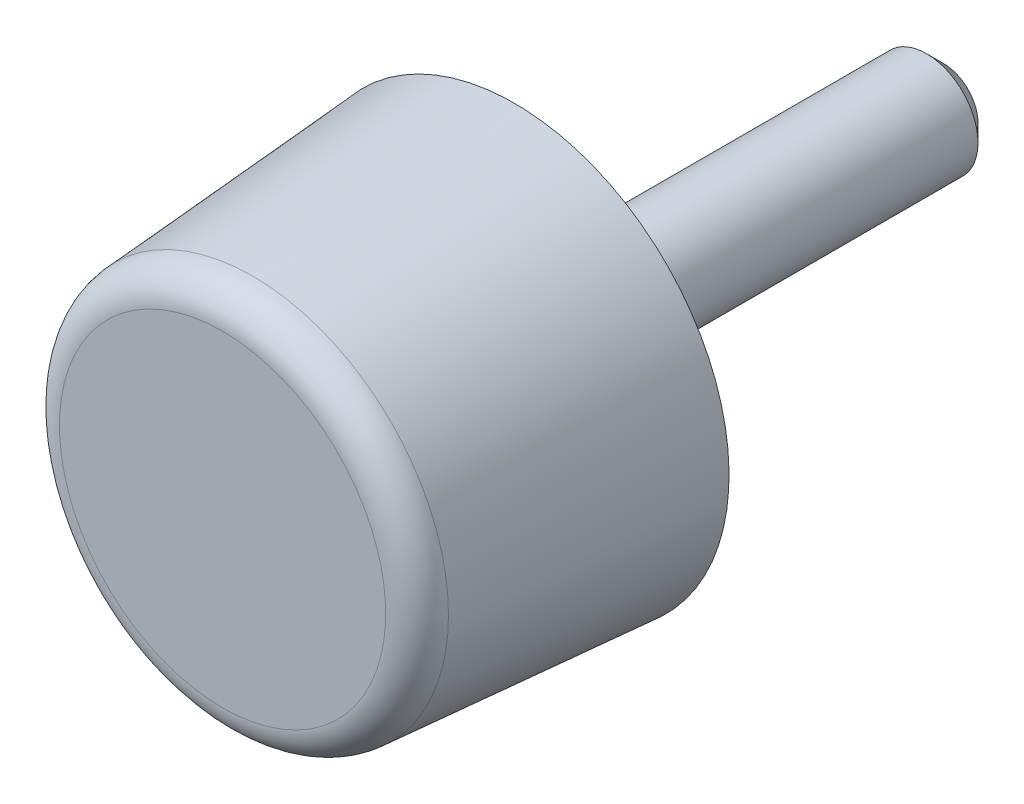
ISO-10303-21;
HEADER;
FILE_DESCRIPTION(('STEP AP214'),'2;1');
FILE_NAME('part.step','',(''),(''),'','','');
FILE_SCHEMA(('AUTOMOTIVE_DESIGN { 1 0 10303 214 1 1 1 1 }'));
ENDSEC;
DATA;
#1=APPLICATION_CONTEXT('core data for automotive mechanical design processes');
#2=APPLICATION_PROTOCOL_DEFINITION('international standard','automotive_design',2000,#1);
#3=PRODUCT_CONTEXT('',#1,'mechanical');
#4=PRODUCT('Part','Part','',(#3));
#5=PRODUCT_RELATED_PRODUCT_CATEGORY('part','',(#4));
#6=PRODUCT_DEFINITION_FORMATION('','',#4);
#7=PRODUCT_DEFINITION_CONTEXT('part definition',#1,'design');
#8=PRODUCT_DEFINITION('design','',#6,#7);
#9=PRODUCT_DEFINITION_SHAPE('','',#8);
#10=(LENGTH_UNIT() NAMED_UNIT(*) SI_UNIT(.MILLI.,.METRE.));
#11=(NAMED_UNIT(*) PLANE_ANGLE_UNIT() SI_UNIT($,.RADIAN.));
#12=(NAMED_UNIT(*) SI_UNIT($,.STERADIAN.) SOLID_ANGLE_UNIT());
#13=UNCERTAINTY_MEASURE_WITH_UNIT(LENGTH_MEASURE(1.E-05),#10,'distance_accuracy_value','');
#14=(GEOMETRIC_REPRESENTATION_CONTEXT(3) GLOBAL_UNCERTAINTY_ASSIGNED_CONTEXT((#13)) GLOBAL_UNIT_ASSIGNED_CONTEXT((#10,
#11,#12)) REPRESENTATION_CONTEXT('',''));
#15=CARTESIAN_POINT('',(0.,0.,0.));
#16=DIRECTION('',(0.,0.,1.));
#17=DIRECTION('',(1.,0.,0.));
#18=AXIS2_PLACEMENT_3D('',#15,#16,#17);
#19=CARTESIAN_POINT('',(0.,0.,17.));
#20=DIRECTION('',(0.,0.,1.));
#21=DIRECTION('',(0.,-1.,0.));
#22=AXIS2_PLACEMENT_3D('',#19,#20,#21);
#23=CYLINDRICAL_SURFACE('',#22,11.25);
#24=CARTESIAN_POINT('',(0.,0.,0.));
#25=DIRECTION('',(0.,0.,1.));
#26=DIRECTION('',(0.,-1.,0.));
#27=AXIS2_PLACEMENT_3D('',#24,#25,#26);
#28=CIRCLE('',#27,11.25);
#29=CARTESIAN_POINT('',(0.,-11.25,0.));
#30=VERTEX_POINT('',#29);
#31=EDGE_CURVE('E27',#30,#30,#28,.T.);
#32=ORIENTED_EDGE('',*,*,#31,.F.);
#33=EDGE_LOOP('',(#32));
#34=FACE_BOUND('',#33,.T.);
#35=CARTESIAN_POINT('',(0.,0.,0.0500000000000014));
#36=DIRECTION('',(0.,0.,1.));
#37=DIRECTION('',(0.,-1.,0.));
#38=AXIS2_PLACEMENT_3D('',#35,#36,#37);
#39=CIRCLE('',#38,11.25);
#40=CARTESIAN_POINT('',(0.,-11.25,0.0500000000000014));
#41=VERTEX_POINT('',#40);
#42=EDGE_CURVE('E44',#41,#41,#39,.T.);
#43=ORIENTED_EDGE('',*,*,#42,.T.);
#44=EDGE_LOOP('',(#43));
#45=FACE_BOUND('',#44,.T.);
#46=ADVANCED_FACE('F12',(#34,#45),#23,.F.);
#47=CARTESIAN_POINT('',(11.25,0.,0.));
#48=DIRECTION('',(0.,0.,1.));
#49=DIRECTION('',(0.,-1.,0.));
#50=AXIS2_PLACEMENT_3D('',#47,#48,#49);
#51=PLANE('',#50);
#52=CARTESIAN_POINT('',(0.,0.,0.));
#53=DIRECTION('',(0.,0.,1.));
#54=DIRECTION('',(0.,-1.,0.));
#55=AXIS2_PLACEMENT_3D('',#52,#53,#54);
#56=CIRCLE('',#55,12.5);
#57=CARTESIAN_POINT('',(0.,-12.5,0.));
#58=VERTEX_POINT('',#57);
#59=EDGE_CURVE('E32',#58,#58,#56,.T.);
#60=ORIENTED_EDGE('',*,*,#59,.F.);
#61=EDGE_LOOP('',(#60));
#62=FACE_BOUND('',#61,.T.);
#63=ORIENTED_EDGE('',*,*,#31,.T.);
#64=EDGE_LOOP('',(#63));
#65=FACE_BOUND('',#64,.T.);
#66=ADVANCED_FACE('F72',(#62,#65),#51,.F.);
#67=CARTESIAN_POINT('',(0.,0.,0.));
#68=DIRECTION('',(0.,0.,-1.));
#69=DIRECTION('',(0.,1.,0.));
#70=AXIS2_PLACEMENT_3D('',#67,#68,#69);
#71=CONICAL_SURFACE('',#70,12.5,0.0723905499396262);
#72=CARTESIAN_POINT('',(0.,0.,15.2374219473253));
#73=DIRECTION('',(0.,0.,1.));
#74=DIRECTION('',(0.,-1.,0.));
#75=AXIS2_PLACEMENT_3D('',#72,#73,#74);
#76=CIRCLE('',#75,11.3950238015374);
#77=CARTESIAN_POINT('',(0.,-11.3950238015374,15.2374219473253));
#78=VERTEX_POINT('',#77);
#79=EDGE_CURVE('E35',#78,#78,#76,.T.);
#80=ORIENTED_EDGE('',*,*,#79,.F.);
#81=EDGE_LOOP('',(#80));
#82=FACE_BOUND('',#81,.T.);
#83=ORIENTED_EDGE('',*,*,#59,.T.);
#84=EDGE_LOOP('',(#83));
#85=FACE_BOUND('',#84,.T.);
#86=ADVANCED_FACE('F77',(#82,#85),#71,.T.);
#87=CARTESIAN_POINT('',(0.,0.,15.1));
#88=DIRECTION('',(0.,0.,1.));
#89=DIRECTION('',(0.,-1.,0.));
#90=AXIS2_PLACEMENT_3D('',#87,#88,#89);
#91=TOROIDAL_SURFACE('',#90,9.5,1.9);
#92=ORIENTED_EDGE('',*,*,#79,.T.);
#93=EDGE_LOOP('',(#92));
#94=FACE_BOUND('',#93,.T.);
#95=CARTESIAN_POINT('',(0.,0.,17.));
#96=DIRECTION('',(0.,0.,1.));
#97=DIRECTION('',(0.,-1.,0.));
#98=AXIS2_PLACEMENT_3D('',#95,#96,#97);
#99=CIRCLE('',#98,9.5);
#100=CARTESIAN_POINT('',(0.,-9.5,17.));
#101=VERTEX_POINT('',#100);
#102=EDGE_CURVE('E38',#101,#101,#99,.T.);
#103=ORIENTED_EDGE('',*,*,#102,.F.);
#104=EDGE_LOOP('',(#103));
#105=FACE_BOUND('',#104,.T.);
#106=ADVANCED_FACE('F84',(#94,#105),#91,.T.);
#107=CARTESIAN_POINT('',(9.5,0.,17.));
#108=DIRECTION('',(0.,0.,-1.));
#109=DIRECTION('',(0.,1.,0.));
#110=AXIS2_PLACEMENT_3D('',#107,#108,#109);
#111=PLANE('',#110);
#112=ORIENTED_EDGE('',*,*,#102,.T.);
#113=EDGE_LOOP('',(#112));
#114=FACE_BOUND('',#113,.T.);
#115=ADVANCED_FACE('F59',(#114),#111,.F.);
#116=CARTESIAN_POINT('',(0.,0.,0.));
#117=DIRECTION('',(0.,0.,1.));
#118=DIRECTION('',(0.,-1.,0.));
#119=AXIS2_PLACEMENT_3D('',#116,#117,#118);
#120=PLANE('',#119);
#121=CARTESIAN_POINT('',(0.,0.,0.));
#122=DIRECTION('',(0.,0.,1.));
#123=DIRECTION('',(0.,-1.,0.));
#124=AXIS2_PLACEMENT_3D('',#121,#122,#123);
#125=CIRCLE('',#124,11.2);
#126=CARTESIAN_POINT('',(0.,-11.2,0.));
#127=VERTEX_POINT('',#126);
#128=EDGE_CURVE('E41',#127,#127,#125,.T.);
#129=ORIENTED_EDGE('',*,*,#128,.F.);
#130=EDGE_LOOP('',(#129));
#131=FACE_BOUND('',#130,.T.);
#132=CARTESIAN_POINT('',(0.,0.,0.));
#133=DIRECTION('',(0.,0.,1.));
#134=DIRECTION('',(0.,-1.,0.));
#135=AXIS2_PLACEMENT_3D('',#132,#133,#134);
#136=CIRCLE('',#135,3.);
#137=CARTESIAN_POINT('',(0.,-3.,0.));
#138=VERTEX_POINT('',#137);
#139=EDGE_CURVE('E23',#138,#138,#136,.T.);
#140=ORIENTED_EDGE('',*,*,#139,.T.);
#141=EDGE_LOOP('',(#140));
#142=FACE_BOUND('',#141,.T.);
#143=ADVANCED_FACE('F53',(#131,#142),#120,.F.);
#144=CARTESIAN_POINT('',(0.,0.,0.));
#145=DIRECTION('',(0.,0.,1.));
#146=DIRECTION('',(0.,-1.,0.));
#147=AXIS2_PLACEMENT_3D('',#144,#145,#146);
#148=CONICAL_SURFACE('',#147,11.2,0.785398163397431);
#149=ORIENTED_EDGE('',*,*,#42,.F.);
#150=EDGE_LOOP('',(#149));
#151=FACE_BOUND('',#150,.T.);
#152=ORIENTED_EDGE('',*,*,#128,.T.);
#153=EDGE_LOOP('',(#152));
#154=FACE_BOUND('',#153,.T.);
#155=ADVANCED_FACE('F49',(#151,#154),#148,.T.);
#156=CARTESIAN_POINT('',(0.,0.,17.));
#157=DIRECTION('',(0.,0.,1.));
#158=DIRECTION('',(0.,-1.,0.));
#159=AXIS2_PLACEMENT_3D('',#156,#157,#158);
#160=CYLINDRICAL_SURFACE('',#159,3.);
#161=CARTESIAN_POINT('',(0.,0.,-24.));
#162=DIRECTION('',(0.,0.,-1.));
#163=DIRECTION('',(0.,1.,0.));
#164=AXIS2_PLACEMENT_3D('',#161,#162,#163);
#165=CIRCLE('',#164,3.);
#166=CARTESIAN_POINT('',(0.,3.,-24.));
#167=VERTEX_POINT('',#166);
#168=EDGE_CURVE('E8',#167,#167,#165,.F.);
#169=ORIENTED_EDGE('',*,*,#168,.T.);
#170=EDGE_LOOP('',(#169));
#171=FACE_BOUND('',#170,.T.);
#172=ORIENTED_EDGE('',*,*,#139,.F.);
#173=EDGE_LOOP('',(#172));
#174=FACE_BOUND('',#173,.T.);
#175=ADVANCED_FACE('F52',(#171,#174),#160,.T.);
#176=CARTESIAN_POINT('',(0.,0.,-25.));
#177=DIRECTION('',(0.,0.,-1.));
#178=DIRECTION('',(0.,1.,0.));
#179=AXIS2_PLACEMENT_3D('',#176,#177,#178);
#180=PLANE('',#179);
#181=CARTESIAN_POINT('',(0.,0.,-25.));
#182=DIRECTION('',(0.,0.,-1.));
#183=DIRECTION('',(0.,1.,0.));
#184=AXIS2_PLACEMENT_3D('',#181,#182,#183);
#185=CIRCLE('',#184,2.);
#186=CARTESIAN_POINT('',(0.,2.,-25.));
#187=VERTEX_POINT('',#186);
#188=EDGE_CURVE('E19',#187,#187,#185,.T.);
#189=ORIENTED_EDGE('',*,*,#188,.T.);
#190=EDGE_LOOP('',(#189));
#191=FACE_BOUND('',#190,.T.);
#192=ADVANCED_FACE('F64',(#191),#180,.T.);
#193=CARTESIAN_POINT('',(0.,0.,-25.));
#194=DIRECTION('',(0.,0.,1.));
#195=DIRECTION('',(0.,-1.,0.));
#196=AXIS2_PLACEMENT_3D('',#193,#194,#195);
#197=CONICAL_SURFACE('',#196,2.,0.785398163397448);
#198=ORIENTED_EDGE('',*,*,#168,.F.);
#199=EDGE_LOOP('',(#198));
#200=FACE_BOUND('',#199,.T.);
#201=ORIENTED_EDGE('',*,*,#188,.F.);
#202=EDGE_LOOP('',(#201));
#203=FACE_BOUND('',#202,.T.);
#204=ADVANCED_FACE('F14',(#200,#203),#197,.T.);
#205=CLOSED_SHELL('',(#46,#66,#86,#106,#115,#143,#155,#175,#192,#204));
#206=MANIFOLD_SOLID_BREP('B1',#205);
#207=ADVANCED_BREP_SHAPE_REPRESENTATION('',(#18,#206),#14);
#208=SHAPE_DEFINITION_REPRESENTATION(#9,#207);
ENDSEC;
END-ISO-10303-21;
